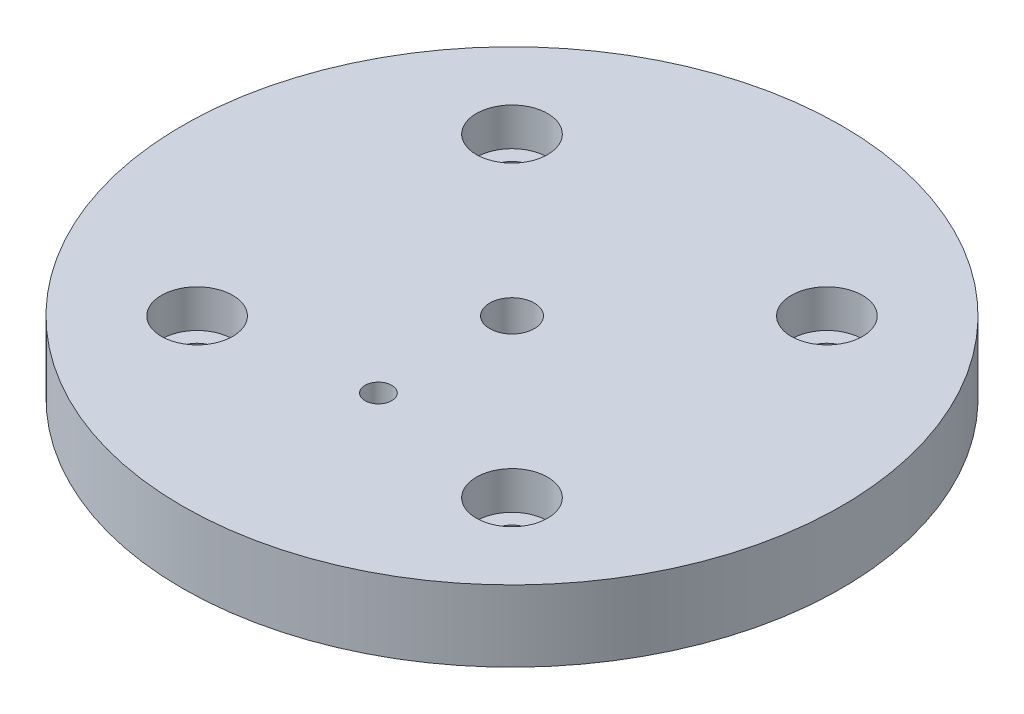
ISO-10303-21;
HEADER;
FILE_DESCRIPTION(('STEP AP214'),'2;1');
FILE_NAME('part.step','',(''),(''),'','','');
FILE_SCHEMA(('AUTOMOTIVE_DESIGN { 1 0 10303 214 1 1 1 1 }'));
ENDSEC;
DATA;
#1=APPLICATION_CONTEXT('core data for automotive mechanical design processes');
#2=APPLICATION_PROTOCOL_DEFINITION('international standard','automotive_design',2000,#1);
#3=PRODUCT_CONTEXT('',#1,'mechanical');
#4=PRODUCT('Part','Part','',(#3));
#5=PRODUCT_RELATED_PRODUCT_CATEGORY('part','',(#4));
#6=PRODUCT_DEFINITION_FORMATION('','',#4);
#7=PRODUCT_DEFINITION_CONTEXT('part definition',#1,'design');
#8=PRODUCT_DEFINITION('design','',#6,#7);
#9=PRODUCT_DEFINITION_SHAPE('','',#8);
#10=(LENGTH_UNIT() NAMED_UNIT(*) SI_UNIT(.MILLI.,.METRE.));
#11=(NAMED_UNIT(*) PLANE_ANGLE_UNIT() SI_UNIT($,.RADIAN.));
#12=(NAMED_UNIT(*) SI_UNIT($,.STERADIAN.) SOLID_ANGLE_UNIT());
#13=UNCERTAINTY_MEASURE_WITH_UNIT(LENGTH_MEASURE(1.E-05),#10,'distance_accuracy_value','');
#14=(GEOMETRIC_REPRESENTATION_CONTEXT(3) GLOBAL_UNCERTAINTY_ASSIGNED_CONTEXT((#13)) GLOBAL_UNIT_ASSIGNED_CONTEXT((#10,
#11,#12)) REPRESENTATION_CONTEXT('',''));
#15=CARTESIAN_POINT('',(0.,0.,0.));
#16=DIRECTION('',(0.,0.,1.));
#17=DIRECTION('',(1.,0.,0.));
#18=AXIS2_PLACEMENT_3D('',#15,#16,#17);
#19=CARTESIAN_POINT('',(0.,8.,0.));
#20=DIRECTION('',(0.,-1.,0.));
#21=DIRECTION('',(0.,0.,-1.));
#22=AXIS2_PLACEMENT_3D('',#19,#20,#21);
#23=CYLINDRICAL_SURFACE('',#22,37.);
#24=CARTESIAN_POINT('',(0.,8.,0.));
#25=DIRECTION('',(0.,1.,0.));
#26=DIRECTION('',(0.,0.,1.));
#27=AXIS2_PLACEMENT_3D('',#24,#25,#26);
#28=CIRCLE('',#27,37.);
#29=CARTESIAN_POINT('',(0.,8.,37.));
#30=VERTEX_POINT('',#29);
#31=EDGE_CURVE('E11',#30,#30,#28,.T.);
#32=ORIENTED_EDGE('',*,*,#31,.F.);
#33=EDGE_LOOP('',(#32));
#34=FACE_BOUND('',#33,.T.);
#35=CARTESIAN_POINT('',(0.,0.,0.));
#36=DIRECTION('',(0.,1.,0.));
#37=DIRECTION('',(0.,0.,1.));
#38=AXIS2_PLACEMENT_3D('',#35,#36,#37);
#39=CIRCLE('',#38,37.);
#40=CARTESIAN_POINT('',(0.,0.,37.));
#41=VERTEX_POINT('',#40);
#42=EDGE_CURVE('E50',#41,#41,#39,.T.);
#43=ORIENTED_EDGE('',*,*,#42,.T.);
#44=EDGE_LOOP('',(#43));
#45=FACE_BOUND('',#44,.T.);
#46=ADVANCED_FACE('F47',(#34,#45),#23,.T.);
#47=CARTESIAN_POINT('',(0.,8.,0.));
#48=DIRECTION('',(0.,1.,0.));
#49=DIRECTION('',(0.,0.,1.));
#50=AXIS2_PLACEMENT_3D('',#47,#48,#49);
#51=PLANE('',#50);
#52=CARTESIAN_POINT('',(0.,8.,15.));
#53=DIRECTION('',(0.,1.,0.));
#54=DIRECTION('',(0.,0.,1.));
#55=AXIS2_PLACEMENT_3D('',#52,#53,#54);
#56=CIRCLE('',#55,1.49999999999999);
#57=CARTESIAN_POINT('',(0.,8.,16.5));
#58=VERTEX_POINT('',#57);
#59=EDGE_CURVE('E69',#58,#58,#56,.T.);
#60=ORIENTED_EDGE('',*,*,#59,.F.);
#61=EDGE_LOOP('',(#60));
#62=FACE_BOUND('',#61,.T.);
#63=CARTESIAN_POINT('',(0.,8.,0.));
#64=DIRECTION('',(0.,1.,0.));
#65=DIRECTION('',(0.,0.,1.));
#66=AXIS2_PLACEMENT_3D('',#63,#64,#65);
#67=CIRCLE('',#66,2.5);
#68=CARTESIAN_POINT('',(0.,8.,2.5));
#69=VERTEX_POINT('',#68);
#70=EDGE_CURVE('E68',#69,#69,#67,.T.);
#71=ORIENTED_EDGE('',*,*,#70,.F.);
#72=EDGE_LOOP('',(#71));
#73=FACE_BOUND('',#72,.T.);
#74=CARTESIAN_POINT('',(-17.6776695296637,8.,-17.6776695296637));
#75=DIRECTION('',(0.,1.,0.));
#76=DIRECTION('',(0.,0.,1.));
#77=AXIS2_PLACEMENT_3D('',#74,#75,#76);
#78=CIRCLE('',#77,3.99999999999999);
#79=CARTESIAN_POINT('',(-17.6776695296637,8.,-13.6776695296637));
#80=VERTEX_POINT('',#79);
#81=EDGE_CURVE('E84',#80,#80,#78,.T.);
#82=ORIENTED_EDGE('',*,*,#81,.F.);
#83=EDGE_LOOP('',(#82));
#84=FACE_BOUND('',#83,.T.);
#85=CARTESIAN_POINT('',(17.6776695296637,8.,-17.6776695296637));
#86=DIRECTION('',(0.,1.,0.));
#87=DIRECTION('',(0.,0.,1.));
#88=AXIS2_PLACEMENT_3D('',#85,#86,#87);
#89=CIRCLE('',#88,3.99999999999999);
#90=CARTESIAN_POINT('',(17.6776695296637,8.,-13.6776695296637));
#91=VERTEX_POINT('',#90);
#92=EDGE_CURVE('E100',#91,#91,#89,.T.);
#93=ORIENTED_EDGE('',*,*,#92,.F.);
#94=EDGE_LOOP('',(#93));
#95=FACE_BOUND('',#94,.T.);
#96=CARTESIAN_POINT('',(-17.6776695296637,8.,17.6776695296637));
#97=DIRECTION('',(0.,1.,0.));
#98=DIRECTION('',(0.,0.,1.));
#99=AXIS2_PLACEMENT_3D('',#96,#97,#98);
#100=CIRCLE('',#99,3.99999999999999);
#101=CARTESIAN_POINT('',(-17.6776695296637,8.,21.6776695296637));
#102=VERTEX_POINT('',#101);
#103=EDGE_CURVE('E116',#102,#102,#100,.T.);
#104=ORIENTED_EDGE('',*,*,#103,.F.);
#105=EDGE_LOOP('',(#104));
#106=FACE_BOUND('',#105,.T.);
#107=CARTESIAN_POINT('',(17.6776695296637,8.,17.6776695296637));
#108=DIRECTION('',(0.,1.,0.));
#109=DIRECTION('',(0.,0.,1.));
#110=AXIS2_PLACEMENT_3D('',#107,#108,#109);
#111=CIRCLE('',#110,3.99999999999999);
#112=CARTESIAN_POINT('',(17.6776695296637,8.,21.6776695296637));
#113=VERTEX_POINT('',#112);
#114=EDGE_CURVE('E132',#113,#113,#111,.T.);
#115=ORIENTED_EDGE('',*,*,#114,.F.);
#116=EDGE_LOOP('',(#115));
#117=FACE_BOUND('',#116,.T.);
#118=ORIENTED_EDGE('',*,*,#31,.T.);
#119=EDGE_LOOP('',(#118));
#120=FACE_BOUND('',#119,.T.);
#121=ADVANCED_FACE('F161',(#62,#73,#84,#95,#106,#117,#120),#51,.T.);
#122=CARTESIAN_POINT('',(0.,0.,0.));
#123=DIRECTION('',(0.,1.,0.));
#124=DIRECTION('',(0.,0.,1.));
#125=AXIS2_PLACEMENT_3D('',#122,#123,#124);
#126=PLANE('',#125);
#127=CARTESIAN_POINT('',(0.,0.,0.));
#128=DIRECTION('',(0.,1.,0.));
#129=DIRECTION('',(0.,0.,1.));
#130=AXIS2_PLACEMENT_3D('',#127,#128,#129);
#131=CIRCLE('',#130,2.5);
#132=CARTESIAN_POINT('',(0.,0.,2.5));
#133=VERTEX_POINT('',#132);
#134=EDGE_CURVE('E76',#133,#133,#131,.T.);
#135=ORIENTED_EDGE('',*,*,#134,.T.);
#136=EDGE_LOOP('',(#135));
#137=FACE_BOUND('',#136,.T.);
#138=CARTESIAN_POINT('',(-17.6776695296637,0.,-17.6776695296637));
#139=DIRECTION('',(0.,1.,0.));
#140=DIRECTION('',(0.,0.,1.));
#141=AXIS2_PLACEMENT_3D('',#138,#139,#140);
#142=CIRCLE('',#141,2.25000000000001);
#143=CARTESIAN_POINT('',(-17.6776695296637,0.,-15.4276695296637));
#144=VERTEX_POINT('',#143);
#145=EDGE_CURVE('E96',#144,#144,#142,.T.);
#146=ORIENTED_EDGE('',*,*,#145,.T.);
#147=EDGE_LOOP('',(#146));
#148=FACE_BOUND('',#147,.T.);
#149=CARTESIAN_POINT('',(17.6776695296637,0.,-17.6776695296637));
#150=DIRECTION('',(0.,1.,0.));
#151=DIRECTION('',(0.,0.,1.));
#152=AXIS2_PLACEMENT_3D('',#149,#150,#151);
#153=CIRCLE('',#152,2.25000000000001);
#154=CARTESIAN_POINT('',(17.6776695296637,0.,-15.4276695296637));
#155=VERTEX_POINT('',#154);
#156=EDGE_CURVE('E112',#155,#155,#153,.T.);
#157=ORIENTED_EDGE('',*,*,#156,.T.);
#158=EDGE_LOOP('',(#157));
#159=FACE_BOUND('',#158,.T.);
#160=CARTESIAN_POINT('',(-17.6776695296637,0.,17.6776695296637));
#161=DIRECTION('',(0.,1.,0.));
#162=DIRECTION('',(0.,0.,1.));
#163=AXIS2_PLACEMENT_3D('',#160,#161,#162);
#164=CIRCLE('',#163,2.25000000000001);
#165=CARTESIAN_POINT('',(-17.6776695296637,0.,19.9276695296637));
#166=VERTEX_POINT('',#165);
#167=EDGE_CURVE('E128',#166,#166,#164,.T.);
#168=ORIENTED_EDGE('',*,*,#167,.T.);
#169=EDGE_LOOP('',(#168));
#170=FACE_BOUND('',#169,.T.);
#171=CARTESIAN_POINT('',(17.6776695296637,0.,17.6776695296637));
#172=DIRECTION('',(0.,1.,0.));
#173=DIRECTION('',(0.,0.,1.));
#174=AXIS2_PLACEMENT_3D('',#171,#172,#173);
#175=CIRCLE('',#174,2.25000000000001);
#176=CARTESIAN_POINT('',(17.6776695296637,0.,19.9276695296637));
#177=VERTEX_POINT('',#176);
#178=EDGE_CURVE('E144',#177,#177,#175,.T.);
#179=ORIENTED_EDGE('',*,*,#178,.T.);
#180=EDGE_LOOP('',(#179));
#181=FACE_BOUND('',#180,.T.);
#182=ORIENTED_EDGE('',*,*,#42,.F.);
#183=EDGE_LOOP('',(#182));
#184=FACE_BOUND('',#183,.T.);
#185=ADVANCED_FACE('F158',(#137,#148,#159,#170,#181,#184),#126,.F.);
#186=CARTESIAN_POINT('',(17.6776695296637,8.,17.6776695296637));
#187=DIRECTION('',(0.,1.,0.));
#188=DIRECTION('',(0.,0.,1.));
#189=AXIS2_PLACEMENT_3D('',#186,#187,#188);
#190=CYLINDRICAL_SURFACE('',#189,2.25);
#191=ORIENTED_EDGE('',*,*,#178,.F.);
#192=EDGE_LOOP('',(#191));
#193=FACE_BOUND('',#192,.T.);
#194=CARTESIAN_POINT('',(17.6776695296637,3.75,17.6776695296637));
#195=DIRECTION('',(0.,1.,0.));
#196=DIRECTION('',(0.,0.,1.));
#197=AXIS2_PLACEMENT_3D('',#194,#195,#196);
#198=CIRCLE('',#197,2.25);
#199=CARTESIAN_POINT('',(17.6776695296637,3.75,19.9276695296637));
#200=VERTEX_POINT('',#199);
#201=EDGE_CURVE('E140',#200,#200,#198,.T.);
#202=ORIENTED_EDGE('',*,*,#201,.T.);
#203=EDGE_LOOP('',(#202));
#204=FACE_BOUND('',#203,.T.);
#205=ADVANCED_FACE('F160',(#193,#204),#190,.F.);
#206=CARTESIAN_POINT('',(19.9276695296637,3.75,17.6776695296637));
#207=DIRECTION('',(0.,-1.,0.));
#208=DIRECTION('',(0.,0.,-1.));
#209=AXIS2_PLACEMENT_3D('',#206,#207,#208);
#210=PLANE('',#209);
#211=ORIENTED_EDGE('',*,*,#201,.F.);
#212=EDGE_LOOP('',(#211));
#213=FACE_BOUND('',#212,.T.);
#214=CARTESIAN_POINT('',(17.6776695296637,3.75,17.6776695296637));
#215=DIRECTION('',(0.,1.,0.));
#216=DIRECTION('',(0.,0.,1.));
#217=AXIS2_PLACEMENT_3D('',#214,#215,#216);
#218=CIRCLE('',#217,4.);
#219=CARTESIAN_POINT('',(17.6776695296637,3.75,21.6776695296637));
#220=VERTEX_POINT('',#219);
#221=EDGE_CURVE('E136',#220,#220,#218,.T.);
#222=ORIENTED_EDGE('',*,*,#221,.T.);
#223=EDGE_LOOP('',(#222));
#224=FACE_BOUND('',#223,.T.);
#225=ADVANCED_FACE('F167',(#213,#224),#210,.F.);
#226=CARTESIAN_POINT('',(17.6776695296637,8.,17.6776695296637));
#227=DIRECTION('',(0.,1.,0.));
#228=DIRECTION('',(0.,0.,1.));
#229=AXIS2_PLACEMENT_3D('',#226,#227,#228);
#230=CYLINDRICAL_SURFACE('',#229,4.);
#231=ORIENTED_EDGE('',*,*,#221,.F.);
#232=EDGE_LOOP('',(#231));
#233=FACE_BOUND('',#232,.T.);
#234=ORIENTED_EDGE('',*,*,#114,.T.);
#235=EDGE_LOOP('',(#234));
#236=FACE_BOUND('',#235,.T.);
#237=ADVANCED_FACE('F205',(#233,#236),#230,.F.);
#238=CARTESIAN_POINT('',(-17.6776695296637,8.,17.6776695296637));
#239=DIRECTION('',(0.,1.,0.));
#240=DIRECTION('',(0.,0.,1.));
#241=AXIS2_PLACEMENT_3D('',#238,#239,#240);
#242=CYLINDRICAL_SURFACE('',#241,2.25);
#243=ORIENTED_EDGE('',*,*,#167,.F.);
#244=EDGE_LOOP('',(#243));
#245=FACE_BOUND('',#244,.T.);
#246=CARTESIAN_POINT('',(-17.6776695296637,3.75,17.6776695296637));
#247=DIRECTION('',(0.,1.,0.));
#248=DIRECTION('',(0.,0.,1.));
#249=AXIS2_PLACEMENT_3D('',#246,#247,#248);
#250=CIRCLE('',#249,2.25);
#251=CARTESIAN_POINT('',(-17.6776695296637,3.75,19.9276695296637));
#252=VERTEX_POINT('',#251);
#253=EDGE_CURVE('E124',#252,#252,#250,.T.);
#254=ORIENTED_EDGE('',*,*,#253,.T.);
#255=EDGE_LOOP('',(#254));
#256=FACE_BOUND('',#255,.T.);
#257=ADVANCED_FACE('F215',(#245,#256),#242,.F.);
#258=CARTESIAN_POINT('',(-15.4276695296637,3.75,17.6776695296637));
#259=DIRECTION('',(0.,-1.,0.));
#260=DIRECTION('',(0.,0.,-1.));
#261=AXIS2_PLACEMENT_3D('',#258,#259,#260);
#262=PLANE('',#261);
#263=ORIENTED_EDGE('',*,*,#253,.F.);
#264=EDGE_LOOP('',(#263));
#265=FACE_BOUND('',#264,.T.);
#266=CARTESIAN_POINT('',(-17.6776695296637,3.75,17.6776695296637));
#267=DIRECTION('',(0.,1.,0.));
#268=DIRECTION('',(0.,0.,1.));
#269=AXIS2_PLACEMENT_3D('',#266,#267,#268);
#270=CIRCLE('',#269,4.);
#271=CARTESIAN_POINT('',(-17.6776695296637,3.75,21.6776695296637));
#272=VERTEX_POINT('',#271);
#273=EDGE_CURVE('E120',#272,#272,#270,.T.);
#274=ORIENTED_EDGE('',*,*,#273,.T.);
#275=EDGE_LOOP('',(#274));
#276=FACE_BOUND('',#275,.T.);
#277=ADVANCED_FACE('F225',(#265,#276),#262,.F.);
#278=CARTESIAN_POINT('',(-17.6776695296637,8.,17.6776695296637));
#279=DIRECTION('',(0.,1.,0.));
#280=DIRECTION('',(0.,0.,1.));
#281=AXIS2_PLACEMENT_3D('',#278,#279,#280);
#282=CYLINDRICAL_SURFACE('',#281,4.);
#283=ORIENTED_EDGE('',*,*,#273,.F.);
#284=EDGE_LOOP('',(#283));
#285=FACE_BOUND('',#284,.T.);
#286=ORIENTED_EDGE('',*,*,#103,.T.);
#287=EDGE_LOOP('',(#286));
#288=FACE_BOUND('',#287,.T.);
#289=ADVANCED_FACE('F235',(#285,#288),#282,.F.);
#290=CARTESIAN_POINT('',(17.6776695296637,8.,-17.6776695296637));
#291=DIRECTION('',(0.,1.,0.));
#292=DIRECTION('',(0.,0.,1.));
#293=AXIS2_PLACEMENT_3D('',#290,#291,#292);
#294=CYLINDRICAL_SURFACE('',#293,2.25);
#295=ORIENTED_EDGE('',*,*,#156,.F.);
#296=EDGE_LOOP('',(#295));
#297=FACE_BOUND('',#296,.T.);
#298=CARTESIAN_POINT('',(17.6776695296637,3.75,-17.6776695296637));
#299=DIRECTION('',(0.,1.,0.));
#300=DIRECTION('',(0.,0.,1.));
#301=AXIS2_PLACEMENT_3D('',#298,#299,#300);
#302=CIRCLE('',#301,2.25);
#303=CARTESIAN_POINT('',(17.6776695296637,3.75,-15.4276695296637));
#304=VERTEX_POINT('',#303);
#305=EDGE_CURVE('E108',#304,#304,#302,.T.);
#306=ORIENTED_EDGE('',*,*,#305,.T.);
#307=EDGE_LOOP('',(#306));
#308=FACE_BOUND('',#307,.T.);
#309=ADVANCED_FACE('F245',(#297,#308),#294,.F.);
#310=CARTESIAN_POINT('',(19.9276695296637,3.75,-17.6776695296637));
#311=DIRECTION('',(0.,-1.,0.));
#312=DIRECTION('',(0.,0.,-1.));
#313=AXIS2_PLACEMENT_3D('',#310,#311,#312);
#314=PLANE('',#313);
#315=ORIENTED_EDGE('',*,*,#305,.F.);
#316=EDGE_LOOP('',(#315));
#317=FACE_BOUND('',#316,.T.);
#318=CARTESIAN_POINT('',(17.6776695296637,3.75,-17.6776695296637));
#319=DIRECTION('',(0.,1.,0.));
#320=DIRECTION('',(0.,0.,1.));
#321=AXIS2_PLACEMENT_3D('',#318,#319,#320);
#322=CIRCLE('',#321,4.);
#323=CARTESIAN_POINT('',(17.6776695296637,3.75,-13.6776695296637));
#324=VERTEX_POINT('',#323);
#325=EDGE_CURVE('E104',#324,#324,#322,.T.);
#326=ORIENTED_EDGE('',*,*,#325,.T.);
#327=EDGE_LOOP('',(#326));
#328=FACE_BOUND('',#327,.T.);
#329=ADVANCED_FACE('F255',(#317,#328),#314,.F.);
#330=CARTESIAN_POINT('',(17.6776695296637,8.,-17.6776695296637));
#331=DIRECTION('',(0.,1.,0.));
#332=DIRECTION('',(0.,0.,1.));
#333=AXIS2_PLACEMENT_3D('',#330,#331,#332);
#334=CYLINDRICAL_SURFACE('',#333,4.);
#335=ORIENTED_EDGE('',*,*,#325,.F.);
#336=EDGE_LOOP('',(#335));
#337=FACE_BOUND('',#336,.T.);
#338=ORIENTED_EDGE('',*,*,#92,.T.);
#339=EDGE_LOOP('',(#338));
#340=FACE_BOUND('',#339,.T.);
#341=ADVANCED_FACE('F265',(#337,#340),#334,.F.);
#342=CARTESIAN_POINT('',(-17.6776695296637,8.,-17.6776695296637));
#343=DIRECTION('',(0.,1.,0.));
#344=DIRECTION('',(0.,0.,1.));
#345=AXIS2_PLACEMENT_3D('',#342,#343,#344);
#346=CYLINDRICAL_SURFACE('',#345,2.25);
#347=ORIENTED_EDGE('',*,*,#145,.F.);
#348=EDGE_LOOP('',(#347));
#349=FACE_BOUND('',#348,.T.);
#350=CARTESIAN_POINT('',(-17.6776695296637,3.75,-17.6776695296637));
#351=DIRECTION('',(0.,1.,0.));
#352=DIRECTION('',(0.,0.,1.));
#353=AXIS2_PLACEMENT_3D('',#350,#351,#352);
#354=CIRCLE('',#353,2.25);
#355=CARTESIAN_POINT('',(-17.6776695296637,3.75,-15.4276695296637));
#356=VERTEX_POINT('',#355);
#357=EDGE_CURVE('E92',#356,#356,#354,.T.);
#358=ORIENTED_EDGE('',*,*,#357,.T.);
#359=EDGE_LOOP('',(#358));
#360=FACE_BOUND('',#359,.T.);
#361=ADVANCED_FACE('F275',(#349,#360),#346,.F.);
#362=CARTESIAN_POINT('',(-15.4276695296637,3.75,-17.6776695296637));
#363=DIRECTION('',(0.,-1.,0.));
#364=DIRECTION('',(0.,0.,-1.));
#365=AXIS2_PLACEMENT_3D('',#362,#363,#364);
#366=PLANE('',#365);
#367=ORIENTED_EDGE('',*,*,#357,.F.);
#368=EDGE_LOOP('',(#367));
#369=FACE_BOUND('',#368,.T.);
#370=CARTESIAN_POINT('',(-17.6776695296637,3.75,-17.6776695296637));
#371=DIRECTION('',(0.,1.,0.));
#372=DIRECTION('',(0.,0.,1.));
#373=AXIS2_PLACEMENT_3D('',#370,#371,#372);
#374=CIRCLE('',#373,4.);
#375=CARTESIAN_POINT('',(-17.6776695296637,3.75,-13.6776695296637));
#376=VERTEX_POINT('',#375);
#377=EDGE_CURVE('E88',#376,#376,#374,.T.);
#378=ORIENTED_EDGE('',*,*,#377,.T.);
#379=EDGE_LOOP('',(#378));
#380=FACE_BOUND('',#379,.T.);
#381=ADVANCED_FACE('F285',(#369,#380),#366,.F.);
#382=CARTESIAN_POINT('',(-17.6776695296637,8.,-17.6776695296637));
#383=DIRECTION('',(0.,1.,0.));
#384=DIRECTION('',(0.,0.,1.));
#385=AXIS2_PLACEMENT_3D('',#382,#383,#384);
#386=CYLINDRICAL_SURFACE('',#385,4.);
#387=ORIENTED_EDGE('',*,*,#377,.F.);
#388=EDGE_LOOP('',(#387));
#389=FACE_BOUND('',#388,.T.);
#390=ORIENTED_EDGE('',*,*,#81,.T.);
#391=EDGE_LOOP('',(#390));
#392=FACE_BOUND('',#391,.T.);
#393=ADVANCED_FACE('F295',(#389,#392),#386,.F.);
#394=CARTESIAN_POINT('',(0.,8.,0.));
#395=DIRECTION('',(0.,1.,0.));
#396=DIRECTION('',(0.,0.,1.));
#397=AXIS2_PLACEMENT_3D('',#394,#395,#396);
#398=CYLINDRICAL_SURFACE('',#397,2.5);
#399=ORIENTED_EDGE('',*,*,#134,.F.);
#400=EDGE_LOOP('',(#399));
#401=FACE_BOUND('',#400,.T.);
#402=ORIENTED_EDGE('',*,*,#70,.T.);
#403=EDGE_LOOP('',(#402));
#404=FACE_BOUND('',#403,.T.);
#405=ADVANCED_FACE('F61',(#401,#404),#398,.F.);
#406=CARTESIAN_POINT('',(0.,5.,15.));
#407=DIRECTION('',(0.,1.,0.));
#408=DIRECTION('',(0.,0.,1.));
#409=AXIS2_PLACEMENT_3D('',#406,#407,#408);
#410=CONICAL_SURFACE('',#409,1.5,1.02974425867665);
#411=CARTESIAN_POINT('',(0.,4.09870907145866,15.));
#412=VERTEX_POINT('',#411);
#413=VERTEX_LOOP('',#412);
#414=FACE_BOUND('',#413,.T.);
#415=CARTESIAN_POINT('',(0.,5.,15.));
#416=DIRECTION('',(0.,1.,0.));
#417=DIRECTION('',(0.,0.,1.));
#418=AXIS2_PLACEMENT_3D('',#415,#416,#417);
#419=CIRCLE('',#418,1.5);
#420=CARTESIAN_POINT('',(0.,5.,16.5));
#421=VERTEX_POINT('',#420);
#422=EDGE_CURVE('E65',#421,#421,#419,.T.);
#423=ORIENTED_EDGE('',*,*,#422,.T.);
#424=EDGE_LOOP('',(#423));
#425=FACE_BOUND('',#424,.T.);
#426=ADVANCED_FACE('F57',(#414,#425),#410,.F.);
#427=CARTESIAN_POINT('',(0.,8.,15.));
#428=DIRECTION('',(0.,1.,0.));
#429=DIRECTION('',(0.,0.,1.));
#430=AXIS2_PLACEMENT_3D('',#427,#428,#429);
#431=CYLINDRICAL_SURFACE('',#430,1.49999999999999);
#432=ORIENTED_EDGE('',*,*,#422,.F.);
#433=EDGE_LOOP('',(#432));
#434=FACE_BOUND('',#433,.T.);
#435=ORIENTED_EDGE('',*,*,#59,.T.);
#436=EDGE_LOOP('',(#435));
#437=FACE_BOUND('',#436,.T.);
#438=ADVANCED_FACE('F60',(#434,#437),#431,.F.);
#439=CLOSED_SHELL('',(#46,#121,#185,#205,#225,#237,#257,#277,#289,#309,#329,#341,#361,#381,#393,
#405,#426,#438));
#440=MANIFOLD_SOLID_BREP('B2',#439);
#441=ADVANCED_BREP_SHAPE_REPRESENTATION('',(#18,#440),#14);
#442=SHAPE_DEFINITION_REPRESENTATION(#9,#441);
ENDSEC;
END-ISO-10303-21;
